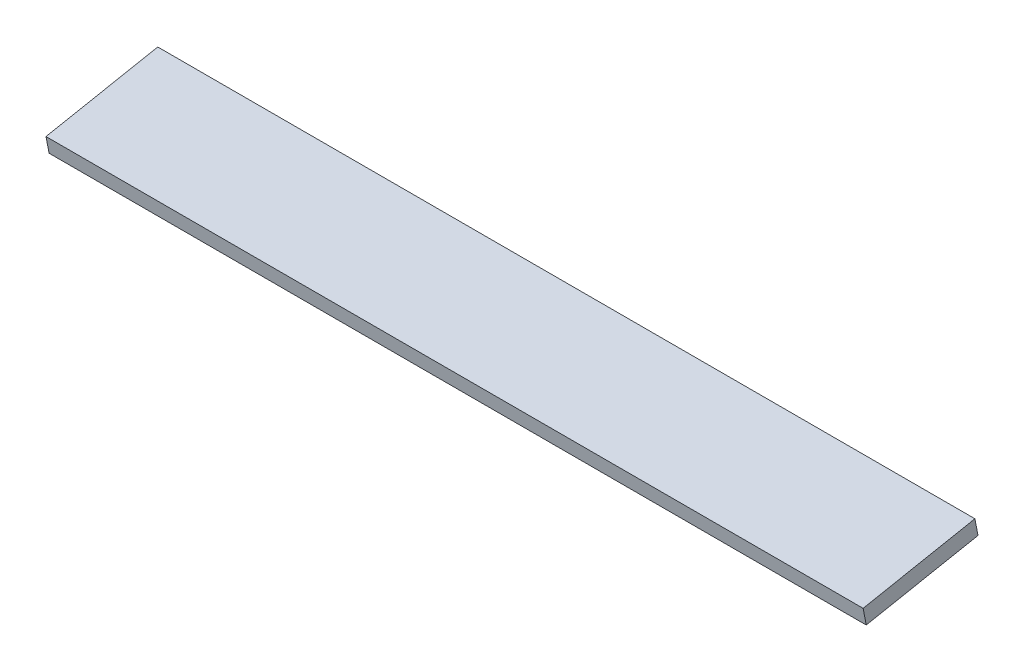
ISO-10303-21;
HEADER;
FILE_DESCRIPTION(('STEP AP214'),'2;1');
FILE_NAME('part.step','',(''),(''),'','','');
FILE_SCHEMA(('AUTOMOTIVE_DESIGN { 1 0 10303 214 1 1 1 1 }'));
ENDSEC;
DATA;
#1=APPLICATION_CONTEXT('core data for automotive mechanical design processes');
#2=APPLICATION_PROTOCOL_DEFINITION('international standard','automotive_design',2000,#1);
#3=PRODUCT_CONTEXT('',#1,'mechanical');
#4=PRODUCT('Part','Part','',(#3));
#5=PRODUCT_RELATED_PRODUCT_CATEGORY('part','',(#4));
#6=PRODUCT_DEFINITION_FORMATION('','',#4);
#7=PRODUCT_DEFINITION_CONTEXT('part definition',#1,'design');
#8=PRODUCT_DEFINITION('design','',#6,#7);
#9=PRODUCT_DEFINITION_SHAPE('','',#8);
#10=(LENGTH_UNIT() NAMED_UNIT(*) SI_UNIT(.MILLI.,.METRE.));
#11=(NAMED_UNIT(*) PLANE_ANGLE_UNIT() SI_UNIT($,.RADIAN.));
#12=(NAMED_UNIT(*) SI_UNIT($,.STERADIAN.) SOLID_ANGLE_UNIT());
#13=UNCERTAINTY_MEASURE_WITH_UNIT(LENGTH_MEASURE(1.E-05),#10,'distance_accuracy_value','');
#14=(GEOMETRIC_REPRESENTATION_CONTEXT(3) GLOBAL_UNCERTAINTY_ASSIGNED_CONTEXT((#13)) GLOBAL_UNIT_ASSIGNED_CONTEXT((#10,
#11,#12)) REPRESENTATION_CONTEXT('',''));
#15=CARTESIAN_POINT('',(0.,0.,0.));
#16=DIRECTION('',(0.,0.,1.));
#17=DIRECTION('',(1.,0.,0.));
#18=AXIS2_PLACEMENT_3D('',#15,#16,#17);
#19=CARTESIAN_POINT('',(-500.,0.,0.));
#20=DIRECTION('',(-1.,0.,0.));
#21=DIRECTION('',(0.,0.,1.));
#22=AXIS2_PLACEMENT_3D('',#19,#20,#21);
#23=PLANE('',#22);
#24=DIRECTION('',(0.,-0.981676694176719,-0.190554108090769));
#25=VECTOR('',#24,1.);
#26=CARTESIAN_POINT('',(-500.,494.152803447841,-10.));
#27=LINE('',#26,#25);
#28=CARTESIAN_POINT('',(-500.,503.969570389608,-8.09445891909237));
#29=VERTEX_POINT('',#28);
#30=CARTESIAN_POINT('',(-500.,494.152803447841,-10.));
#31=VERTEX_POINT('',#30);
#32=EDGE_CURVE('E83',#29,#31,#27,.T.);
#33=ORIENTED_EDGE('',*,*,#32,.F.);
#34=DIRECTION('',(0.,-0.19055410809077,0.981676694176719));
#35=VECTOR('',#34,1.);
#36=CARTESIAN_POINT('',(-500.,503.969570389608,-8.09445891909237));
#37=LINE('',#36,#35);
#38=CARTESIAN_POINT('',(-500.,517.243613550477,-76.4782840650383));
#39=VERTEX_POINT('',#38);
#40=EDGE_CURVE('E94',#39,#29,#37,.T.);
#41=ORIENTED_EDGE('',*,*,#40,.F.);
#42=DIRECTION('',(0.,0.981676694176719,0.190554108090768));
#43=VECTOR('',#42,1.);
#44=CARTESIAN_POINT('',(-500.,507.42684660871,-78.3838251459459));
#45=LINE('',#44,#43);
#46=CARTESIAN_POINT('',(-500.,507.42684660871,-78.3838251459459));
#47=VERTEX_POINT('',#46);
#48=EDGE_CURVE('E85',#47,#39,#45,.T.);
#49=ORIENTED_EDGE('',*,*,#48,.F.);
#50=DIRECTION('',(0.,0.190554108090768,-0.981676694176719));
#51=VECTOR('',#50,1.);
#52=CARTESIAN_POINT('',(-500.,494.152803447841,-10.));
#53=LINE('',#52,#51);
#54=EDGE_CURVE('E75',#31,#47,#53,.T.);
#55=ORIENTED_EDGE('',*,*,#54,.F.);
#56=EDGE_LOOP('',(#33,#41,#49,#55));
#57=FACE_BOUND('',#56,.T.);
#58=ADVANCED_FACE('F33',(#57),#23,.T.);
#59=CARTESIAN_POINT('',(73.9850019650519,503.969570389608,-8.09445891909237));
#60=DIRECTION('',(0.,-0.981676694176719,-0.19055410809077));
#61=DIRECTION('',(0.,0.19055410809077,-0.981676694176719));
#62=AXIS2_PLACEMENT_3D('',#59,#60,#61);
#63=PLANE('',#62);
#64=DIRECTION('',(-1.,0.,0.));
#65=VECTOR('',#64,1.);
#66=CARTESIAN_POINT('',(73.9850019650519,503.969570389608,-8.09445891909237));
#67=LINE('',#66,#65);
#68=CARTESIAN_POINT('',(0.,503.969570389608,-8.09445891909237));
#69=VERTEX_POINT('',#68);
#70=EDGE_CURVE('E88',#69,#29,#67,.T.);
#71=ORIENTED_EDGE('',*,*,#70,.F.);
#72=DIRECTION('',(0.,0.19055410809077,-0.981676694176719));
#73=VECTOR('',#72,1.);
#74=CARTESIAN_POINT('',(0.,503.969570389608,-8.09445891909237));
#75=LINE('',#74,#73);
#76=CARTESIAN_POINT('',(0.,517.243613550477,-76.4782840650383));
#77=VERTEX_POINT('',#76);
#78=EDGE_CURVE('E37',#69,#77,#75,.T.);
#79=ORIENTED_EDGE('',*,*,#78,.T.);
#80=DIRECTION('',(-1.,0.,0.));
#81=VECTOR('',#80,1.);
#82=CARTESIAN_POINT('',(73.9850019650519,517.243613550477,-76.4782840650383));
#83=LINE('',#82,#81);
#84=EDGE_CURVE('E97',#77,#39,#83,.T.);
#85=ORIENTED_EDGE('',*,*,#84,.T.);
#86=ORIENTED_EDGE('',*,*,#40,.T.);
#87=EDGE_LOOP('',(#71,#79,#85,#86));
#88=FACE_BOUND('',#87,.T.);
#89=ADVANCED_FACE('F106',(#88),#63,.F.);
#90=CARTESIAN_POINT('',(73.9850019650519,507.42684660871,-78.3838251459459));
#91=DIRECTION('',(0.,-0.190554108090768,0.981676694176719));
#92=DIRECTION('',(0.,-0.981676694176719,-0.190554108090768));
#93=AXIS2_PLACEMENT_3D('',#90,#91,#92);
#94=PLANE('',#93);
#95=ORIENTED_EDGE('',*,*,#84,.F.);
#96=DIRECTION('',(0.,-0.981676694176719,-0.190554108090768));
#97=VECTOR('',#96,1.);
#98=CARTESIAN_POINT('',(0.,507.42684660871,-78.3838251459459));
#99=LINE('',#98,#97);
#100=CARTESIAN_POINT('',(0.,507.42684660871,-78.3838251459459));
#101=VERTEX_POINT('',#100);
#102=EDGE_CURVE('E103',#77,#101,#99,.T.);
#103=ORIENTED_EDGE('',*,*,#102,.T.);
#104=DIRECTION('',(-1.,0.,0.));
#105=VECTOR('',#104,1.);
#106=CARTESIAN_POINT('',(73.9850019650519,507.42684660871,-78.3838251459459));
#107=LINE('',#106,#105);
#108=EDGE_CURVE('E79',#101,#47,#107,.T.);
#109=ORIENTED_EDGE('',*,*,#108,.T.);
#110=ORIENTED_EDGE('',*,*,#48,.T.);
#111=EDGE_LOOP('',(#95,#103,#109,#110));
#112=FACE_BOUND('',#111,.T.);
#113=ADVANCED_FACE('F102',(#112),#94,.F.);
#114=CARTESIAN_POINT('',(73.9850019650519,494.152803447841,-10.));
#115=DIRECTION('',(0.,0.981676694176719,0.190554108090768));
#116=DIRECTION('',(0.,-0.190554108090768,0.981676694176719));
#117=AXIS2_PLACEMENT_3D('',#114,#115,#116);
#118=PLANE('',#117);
#119=ORIENTED_EDGE('',*,*,#108,.F.);
#120=DIRECTION('',(0.,-0.190554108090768,0.981676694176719));
#121=VECTOR('',#120,1.);
#122=CARTESIAN_POINT('',(0.,494.152803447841,-10.));
#123=LINE('',#122,#121);
#124=CARTESIAN_POINT('',(0.,494.152803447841,-10.));
#125=VERTEX_POINT('',#124);
#126=EDGE_CURVE('E42',#101,#125,#123,.T.);
#127=ORIENTED_EDGE('',*,*,#126,.T.);
#128=DIRECTION('',(-1.,0.,0.));
#129=VECTOR('',#128,1.);
#130=CARTESIAN_POINT('',(73.9850019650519,494.152803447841,-10.));
#131=LINE('',#130,#129);
#132=EDGE_CURVE('E72',#125,#31,#131,.T.);
#133=ORIENTED_EDGE('',*,*,#132,.T.);
#134=ORIENTED_EDGE('',*,*,#54,.T.);
#135=EDGE_LOOP('',(#119,#127,#133,#134));
#136=FACE_BOUND('',#135,.T.);
#137=ADVANCED_FACE('F74',(#136),#118,.F.);
#138=CARTESIAN_POINT('',(73.9850019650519,494.152803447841,-10.));
#139=DIRECTION('',(0.,0.190554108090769,-0.981676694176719));
#140=DIRECTION('',(0.,0.981676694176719,0.190554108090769));
#141=AXIS2_PLACEMENT_3D('',#138,#139,#140);
#142=PLANE('',#141);
#143=ORIENTED_EDGE('',*,*,#132,.F.);
#144=DIRECTION('',(0.,0.981676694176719,0.190554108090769));
#145=VECTOR('',#144,1.);
#146=CARTESIAN_POINT('',(0.,494.152803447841,-10.));
#147=LINE('',#146,#145);
#148=EDGE_CURVE('E11',#125,#69,#147,.T.);
#149=ORIENTED_EDGE('',*,*,#148,.T.);
#150=ORIENTED_EDGE('',*,*,#70,.T.);
#151=ORIENTED_EDGE('',*,*,#32,.T.);
#152=EDGE_LOOP('',(#143,#149,#150,#151));
#153=FACE_BOUND('',#152,.T.);
#154=ADVANCED_FACE('F35',(#153),#142,.F.);
#155=CARTESIAN_POINT('',(0.,593.86769603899,-52.1972085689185));
#156=DIRECTION('',(-1.,0.,0.));
#157=DIRECTION('',(0.,0.229075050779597,0.973408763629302));
#158=AXIS2_PLACEMENT_3D('',#155,#156,#157);
#159=PLANE('',#158);
#160=ORIENTED_EDGE('',*,*,#126,.F.);
#161=ORIENTED_EDGE('',*,*,#102,.F.);
#162=ORIENTED_EDGE('',*,*,#78,.F.);
#163=ORIENTED_EDGE('',*,*,#148,.F.);
#164=EDGE_LOOP('',(#160,#161,#162,#163));
#165=FACE_BOUND('',#164,.T.);
#166=ADVANCED_FACE('F120',(#165),#159,.F.);
#167=CLOSED_SHELL('',(#58,#89,#113,#137,#154,#166));
#168=MANIFOLD_SOLID_BREP('B2',#167);
#169=ADVANCED_BREP_SHAPE_REPRESENTATION('',(#18,#168),#14);
#170=SHAPE_DEFINITION_REPRESENTATION(#9,#169);
ENDSEC;
END-ISO-10303-21;
